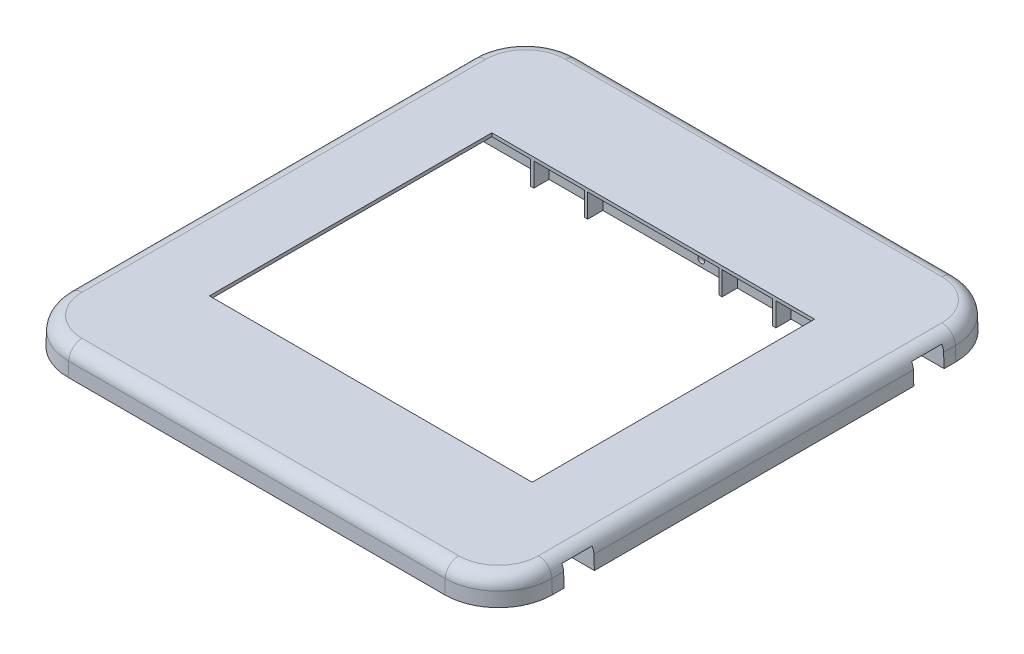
from build123d import *

# Parameters (mm, degrees)
EXTRUDE1_DEPTH     = 25.4
DRAFT1_ANGLE       = -2
FILLET1_R          = 12.7
SHELL2_T           = -3.175
RIB1_REACH         = 335.36
SKETCH3_WALLS_W    = 1109.591591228
SKETCH3_WALLS_H    = 3.175
SKETCH3_WALLS_W_2  = 1112.768526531
SKETCH4_W          = 28.575
SKETCH4_H          = 19.05
CUT_EXTRUDE2_DEPTH = 334.359880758
CUT_EXTRUDE3_REACH = 360.76
CUT_EXTRUDE3_START = 25.4
SKETCH6_R          = 3.175
RIB4_REACH         = 334.936
SKETCH9_WALLS_W    = 3.175
SKETCH9_WALLS_H    = 696.447518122
RIB4_DRAFT_ANGLE   = 2
RIB5_REACH         = 335.36
SKETCH11_WALLS_W   = 3.175
SKETCH11_WALLS_H   = 963.994761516
SKETCH11_WALLS_H_2 = 967.169761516
SKETCH10_W         = 304.8
SKETCH10_H         = 266.7
CUT_EXTRUDE4_DEPTH = 334.359880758


with BuildPart() as part:
    # Sketch1 → Extrude1 (new body)
    with BuildSketch(Plane(origin=(0, 0, 0), x_dir=(1, 0, 0), z_dir=(0, 1, 0))):
        with BuildLine():
            Line((228.6, 0), (228.6, 190.5))
            ThreePointArc((228.6, 190.5), (213.721024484, 226.421024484), (177.8, 241.3))
            Line((177.8, 241.3), (-177.8, 241.3))
            ThreePointArc((-177.8, 241.3), (-213.721024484, 226.421024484), (-228.6, 190.5))
            Line((-228.6, 190.5), (-228.6, 0))
            Line((-228.6, 0), (228.6, 0))
        make_face()
    extrude(amount=EXTRUDE1_DEPTH)

    # Draft1
    draft1_faces = [part.faces().sort_by_distance(p)[0] for p in [
        (228.6, 12.7, -95.25),
    ]]
    draft(draft1_faces, Plane(origin=(-177.8, 0, -190.5), x_dir=(0, 0, -1), z_dir=(0, -1, 0)), DRAFT1_ANGLE)

    # Fillet1
    fillet1_edges = [part.edges().sort_by_distance(p)[0] for p in [
        (227.713012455, 25.4, -95.25),
        (213.093829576, 25.4, -225.793829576),
        (0, 25.4, -240.413012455),
        (-213.093829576, 25.4, -225.793829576),
        (-227.713012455, 25.4, -95.25),
    ]]
    fillet(fillet1_edges, radius=FILLET1_R)

    # Shell2
    shell2_openings = [part.faces().sort_by_distance(p)[0] for p in [
        (0, 12.636517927, 0),
        (0, 0, -119.541485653),
    ]]
    offset(amount=SHELL2_T, openings=shell2_openings, kind=Kind.INTERSECTION)

    # Sketch3 walls → Rib1 (add, up to next)
    with BuildSketch(Plane.XZ, mode=Mode.PRIVATE) as rib1_sk1:
        with Locations((-4.987149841, -149.225)):
            Rectangle(SKETCH3_WALLS_W, SKETCH3_WALLS_H)
    rib1_tool1 = extrude(rib1_sk1.sketch, amount=-RIB1_REACH, mode=Mode.PRIVATE) - part.part
    # Sketch3 walls → Rib1 (add, up to next)
    with BuildSketch(Plane.XZ, mode=Mode.PRIVATE) as rib1_sk2:
        with Locations((-6.575617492, -180.975)):
            Rectangle(SKETCH3_WALLS_W_2, SKETCH3_WALLS_H)
    rib1_tool2 = extrude(rib1_sk2.sketch, amount=-RIB1_REACH, mode=Mode.PRIVATE) - part.part
    add(rib1_tool1.solids().sort_by_distance((-4.987149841, 0, -149.225))[0])
    add(rib1_tool2.solids().sort_by_distance((-6.575617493, 0, -180.975))[0])

    # Sketch4 → Cut-Extrude2 (cut, through all)
    with BuildSketch(Plane(origin=(0, 0, 0), x_dir=(0, 0, -1), z_dir=(1, 0, 0))):
        with Locations((165.1, 9.525)):
            Rectangle(SKETCH4_W, SKETCH4_H)
    extrude(amount=CUT_EXTRUDE2_DEPTH, mode=Mode.SUBTRACT)

    # Sketch6 → Cut-Extrude3 (cut, up to next)
    with BuildSketch(Plane.XY.offset(CUT_EXTRUDE3_START), mode=Mode.PRIVATE) as cut_extrude3_sk1:
        with Locations((208.935409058, 6.35)):
            Circle(SKETCH6_R)
    cut_extrude3_tool1 = extrude(cut_extrude3_sk1.sketch, amount=-CUT_EXTRUDE3_REACH, mode=Mode.PRIVATE) & part.part
    # Sketch6 → Cut-Extrude3 (cut, up to next)
    with BuildSketch(Plane.XY.offset(CUT_EXTRUDE3_START), mode=Mode.PRIVATE) as cut_extrude3_sk2:
        with Locations((31.135409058, 6.35)):
            Circle(SKETCH6_R)
    cut_extrude3_tool2 = extrude(cut_extrude3_sk2.sketch, amount=-CUT_EXTRUDE3_REACH, mode=Mode.PRIVATE) & part.part
    add(cut_extrude3_tool1.solids().sort_by_distance((208.935409, 6.35, 25.4))[0], mode=Mode.SUBTRACT)
    add(cut_extrude3_tool1.solids().sort_by_distance((208.935409, 6.35, 25.4))[1], mode=Mode.SUBTRACT)
    add(cut_extrude3_tool2.solids().sort_by_distance((31.135409, 6.35, 25.4))[0], mode=Mode.SUBTRACT)
    add(cut_extrude3_tool2.solids().sort_by_distance((31.135409, 6.35, 25.4))[1], mode=Mode.SUBTRACT)

    # Sketch9 walls → Rib4 (add, up to next)
    with BuildSketch(Plane.XZ.offset(-19.05), mode=Mode.PRIVATE) as rib4_sk1:
        with Locations((63.5, -165.1)):
            Rectangle(SKETCH9_WALLS_W, SKETCH9_WALLS_H)
    rib4_tool1 = extrude(rib4_sk1.sketch, amount=-RIB4_REACH, mode=Mode.PRIVATE) - part.part
    # Sketch9 walls → Rib4 (add, up to next)
    with BuildSketch(Plane.XZ.offset(-19.05), mode=Mode.PRIVATE) as rib4_sk2:
        with Locations((-63.5, -165.1)):
            Rectangle(SKETCH9_WALLS_W, SKETCH9_WALLS_H)
    rib4_tool2 = extrude(rib4_sk2.sketch, amount=-RIB4_REACH, mode=Mode.PRIVATE) - part.part
    add(rib4_tool1.solids().sort_by_distance((63.5, 19.05, -165.1))[0])
    add(rib4_tool2.solids().sort_by_distance((-63.5, 19.05, -165.1))[0])

    # Rib4 draft
    rib4_draft_faces = [part.faces().sort_by_distance(p)[0] for p in [
        (61.9125, 19.55, -165.1),
        (65.0875, 19.55, -165.1),
        (-65.0875, 19.55, -165.1),
        (-61.9125, 19.55, -165.1),
    ]]
    draft(rib4_draft_faces, Plane(origin=(63.5, 19.05, -165.1), x_dir=(1, 0, 0), z_dir=(0, -1, 0)), RIB4_DRAFT_ANGLE)

    # Mirror1: part across plane


with BuildPart() as part_1:
    add(part.part)
    add(part.part.mirror(Plane(origin=(-228.6, 25.4, 0), x_dir=(1, 0, 0), z_dir=(0, 0, -1))))

    # Sketch11 walls → Rib5 (add, up to next)
    with BuildSketch(Plane.XZ, mode=Mode.PRIVATE) as rib5_sk1:
        with Locations((63.5, 0)):
            Rectangle(SKETCH11_WALLS_W, SKETCH11_WALLS_H)
    rib5_tool1 = extrude(rib5_sk1.sketch, amount=-RIB5_REACH, mode=Mode.PRIVATE) - part_1.part
    # Sketch11 walls → Rib5 (add, up to next)
    with BuildSketch(Plane.XZ, mode=Mode.PRIVATE) as rib5_sk2:
        with Locations((-63.5, -1.5875)):
            Rectangle(SKETCH11_WALLS_W, SKETCH11_WALLS_H_2)
    rib5_tool2 = extrude(rib5_sk2.sketch, amount=-RIB5_REACH, mode=Mode.PRIVATE) - part_1.part
    # Sketch11 walls → Rib5 (add, up to next)
    with BuildSketch(Plane.XZ, mode=Mode.PRIVATE) as rib5_sk3:
        with Locations((114.3, 0)):
            Rectangle(SKETCH11_WALLS_W, SKETCH11_WALLS_H)
    rib5_tool3 = extrude(rib5_sk3.sketch, amount=-RIB5_REACH, mode=Mode.PRIVATE) - part_1.part
    # Sketch11 walls → Rib5 (add, up to next)
    with BuildSketch(Plane.XZ, mode=Mode.PRIVATE) as rib5_sk4:
        with Locations((-114.3, -1.5875)):
            Rectangle(SKETCH11_WALLS_W, SKETCH11_WALLS_H_2)
    rib5_tool4 = extrude(rib5_sk4.sketch, amount=-RIB5_REACH, mode=Mode.PRIVATE) - part_1.part
    add(rib5_tool1.solids().sort_by_distance((63.5, 0, 0))[0])
    add(rib5_tool2.solids().sort_by_distance((-63.5, 0, -1.5875))[0])
    add(rib5_tool3.solids().sort_by_distance((114.3, 0, 0))[0])
    add(rib5_tool4.solids().sort_by_distance((-114.3, 0, -1.5875))[0])

    # Sketch10 → Cut-Extrude4 (cut, through all)
    with BuildSketch(Plane(origin=(0, 25.4, 0), x_dir=(-1, 0, 0), z_dir=(0, 1, 0))):
        Rectangle(SKETCH10_W, SKETCH10_H)
    extrude(amount=-CUT_EXTRUDE4_DEPTH, mode=Mode.SUBTRACT)


solid = part_1.part
